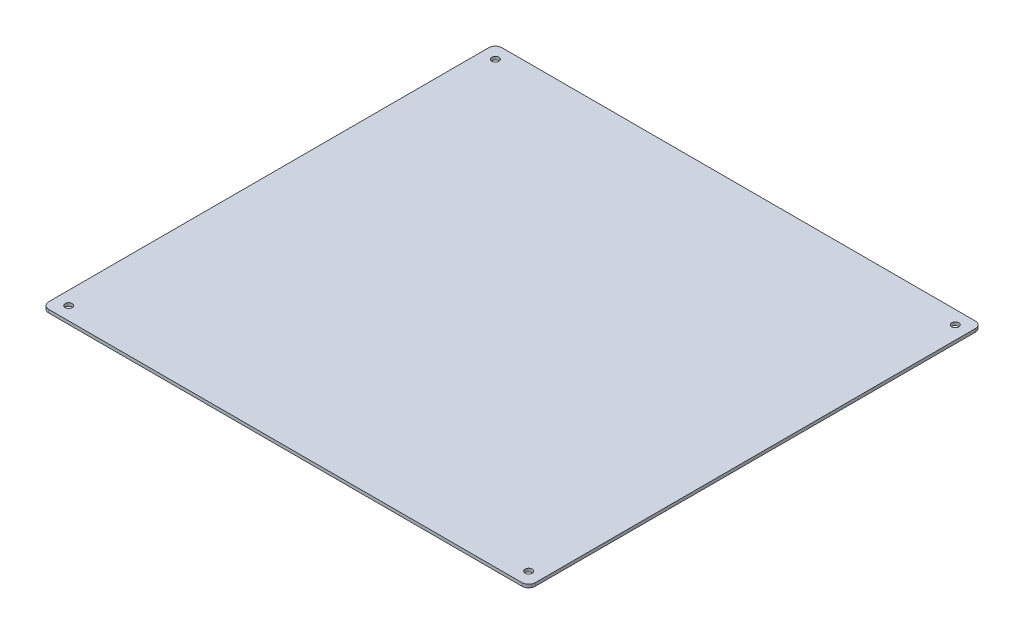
ISO-10303-21;
HEADER;
FILE_DESCRIPTION(('STEP AP214'),'2;1');
FILE_NAME('part.step','',(''),(''),'','','');
FILE_SCHEMA(('AUTOMOTIVE_DESIGN { 1 0 10303 214 1 1 1 1 }'));
ENDSEC;
DATA;
#1=APPLICATION_CONTEXT('core data for automotive mechanical design processes');
#2=APPLICATION_PROTOCOL_DEFINITION('international standard','automotive_design',2000,#1);
#3=PRODUCT_CONTEXT('',#1,'mechanical');
#4=PRODUCT('Part','Part','',(#3));
#5=PRODUCT_RELATED_PRODUCT_CATEGORY('part','',(#4));
#6=PRODUCT_DEFINITION_FORMATION('','',#4);
#7=PRODUCT_DEFINITION_CONTEXT('part definition',#1,'design');
#8=PRODUCT_DEFINITION('design','',#6,#7);
#9=PRODUCT_DEFINITION_SHAPE('','',#8);
#10=(LENGTH_UNIT() NAMED_UNIT(*) SI_UNIT(.MILLI.,.METRE.));
#11=(NAMED_UNIT(*) PLANE_ANGLE_UNIT() SI_UNIT($,.RADIAN.));
#12=(NAMED_UNIT(*) SI_UNIT($,.STERADIAN.) SOLID_ANGLE_UNIT());
#13=UNCERTAINTY_MEASURE_WITH_UNIT(LENGTH_MEASURE(1.E-05),#10,'distance_accuracy_value','');
#14=(GEOMETRIC_REPRESENTATION_CONTEXT(3) GLOBAL_UNCERTAINTY_ASSIGNED_CONTEXT((#13)) GLOBAL_UNIT_ASSIGNED_CONTEXT((#10,
#11,#12)) REPRESENTATION_CONTEXT('',''));
#15=CARTESIAN_POINT('',(0.,0.,0.));
#16=DIRECTION('',(0.,0.,1.));
#17=DIRECTION('',(1.,0.,0.));
#18=AXIS2_PLACEMENT_3D('',#15,#16,#17);
#19=CARTESIAN_POINT('',(0.,0.,0.));
#20=DIRECTION('',(0.,-1.,0.));
#21=DIRECTION('',(0.,0.,-1.));
#22=AXIS2_PLACEMENT_3D('',#19,#20,#21);
#23=PLANE('',#22);
#24=CARTESIAN_POINT('',(-219.075,0.,-203.2));
#25=DIRECTION('',(0.,1.,0.));
#26=DIRECTION('',(0.,0.,1.));
#27=AXIS2_PLACEMENT_3D('',#24,#25,#26);
#28=CIRCLE('',#27,3.373501);
#29=CARTESIAN_POINT('',(-219.075,0.,-199.826499));
#30=VERTEX_POINT('',#29);
#31=EDGE_CURVE('E229',#30,#30,#28,.T.);
#32=ORIENTED_EDGE('',*,*,#31,.T.);
#33=EDGE_LOOP('',(#32));
#34=FACE_BOUND('',#33,.T.);
#35=DIRECTION('',(-1.,0.,0.));
#36=VECTOR('',#35,1.);
#37=CARTESIAN_POINT('',(-231.775,0.,-215.9));
#38=LINE('',#37,#36);
#39=CARTESIAN_POINT('',(225.425,0.,-215.9));
#40=VERTEX_POINT('',#39);
#41=CARTESIAN_POINT('',(-225.425,0.,-215.9));
#42=VERTEX_POINT('',#41);
#43=EDGE_CURVE('E121',#40,#42,#38,.T.);
#44=ORIENTED_EDGE('',*,*,#43,.F.);
#45=CARTESIAN_POINT('',(225.425,0.,-209.55));
#46=DIRECTION('',(0.,-1.,0.));
#47=DIRECTION('',(0.,0.,-1.));
#48=AXIS2_PLACEMENT_3D('',#45,#46,#47);
#49=CIRCLE('',#48,6.35);
#50=CARTESIAN_POINT('',(231.775,0.,-209.55));
#51=VERTEX_POINT('',#50);
#52=EDGE_CURVE('E103',#40,#51,#49,.T.);
#53=ORIENTED_EDGE('',*,*,#52,.T.);
#54=DIRECTION('',(0.,0.,-1.));
#55=VECTOR('',#54,1.);
#56=CARTESIAN_POINT('',(231.775,0.,215.9));
#57=LINE('',#56,#55);
#58=CARTESIAN_POINT('',(231.775,0.,209.55));
#59=VERTEX_POINT('',#58);
#60=EDGE_CURVE('E133',#59,#51,#57,.T.);
#61=ORIENTED_EDGE('',*,*,#60,.F.);
#62=CARTESIAN_POINT('',(225.425,0.,209.55));
#63=DIRECTION('',(0.,-1.,0.));
#64=DIRECTION('',(0.,0.,-1.));
#65=AXIS2_PLACEMENT_3D('',#62,#63,#64);
#66=CIRCLE('',#65,6.35);
#67=CARTESIAN_POINT('',(225.425,0.,215.9));
#68=VERTEX_POINT('',#67);
#69=EDGE_CURVE('E115',#59,#68,#66,.T.);
#70=ORIENTED_EDGE('',*,*,#69,.T.);
#71=DIRECTION('',(1.,0.,0.));
#72=VECTOR('',#71,1.);
#73=CARTESIAN_POINT('',(-231.775,0.,215.9));
#74=LINE('',#73,#72);
#75=CARTESIAN_POINT('',(-225.425,0.,215.9));
#76=VERTEX_POINT('',#75);
#77=EDGE_CURVE('E139',#76,#68,#74,.T.);
#78=ORIENTED_EDGE('',*,*,#77,.F.);
#79=CARTESIAN_POINT('',(-225.425,0.,209.55));
#80=DIRECTION('',(0.,-1.,0.));
#81=DIRECTION('',(0.,0.,-1.));
#82=AXIS2_PLACEMENT_3D('',#79,#80,#81);
#83=CIRCLE('',#82,6.35);
#84=CARTESIAN_POINT('',(-231.775,0.,209.55));
#85=VERTEX_POINT('',#84);
#86=EDGE_CURVE('E153',#76,#85,#83,.T.);
#87=ORIENTED_EDGE('',*,*,#86,.T.);
#88=DIRECTION('',(0.,0.,1.));
#89=VECTOR('',#88,1.);
#90=CARTESIAN_POINT('',(-231.775,0.,215.9));
#91=LINE('',#90,#89);
#92=CARTESIAN_POINT('',(-231.775,0.,-209.55));
#93=VERTEX_POINT('',#92);
#94=EDGE_CURVE('E132',#93,#85,#91,.T.);
#95=ORIENTED_EDGE('',*,*,#94,.F.);
#96=CARTESIAN_POINT('',(-225.425,0.,-209.55));
#97=DIRECTION('',(0.,-1.,0.));
#98=DIRECTION('',(0.,0.,-1.));
#99=AXIS2_PLACEMENT_3D('',#96,#97,#98);
#100=CIRCLE('',#99,6.35);
#101=EDGE_CURVE('E126',#93,#42,#100,.T.);
#102=ORIENTED_EDGE('',*,*,#101,.T.);
#103=EDGE_LOOP('',(#44,#53,#61,#70,#78,#87,#95,#102));
#104=FACE_BOUND('',#103,.T.);
#105=CARTESIAN_POINT('',(219.075,0.,-203.2));
#106=DIRECTION('',(0.,1.,0.));
#107=DIRECTION('',(0.,0.,1.));
#108=AXIS2_PLACEMENT_3D('',#105,#106,#107);
#109=CIRCLE('',#108,3.373501);
#110=CARTESIAN_POINT('',(219.075,0.,-199.826499));
#111=VERTEX_POINT('',#110);
#112=EDGE_CURVE('E141',#111,#111,#109,.T.);
#113=ORIENTED_EDGE('',*,*,#112,.T.);
#114=EDGE_LOOP('',(#113));
#115=FACE_BOUND('',#114,.T.);
#116=CARTESIAN_POINT('',(219.075,0.,203.2));
#117=DIRECTION('',(0.,1.,0.));
#118=DIRECTION('',(0.,0.,1.));
#119=AXIS2_PLACEMENT_3D('',#116,#117,#118);
#120=CIRCLE('',#119,3.373501);
#121=CARTESIAN_POINT('',(219.075,0.,206.573501));
#122=VERTEX_POINT('',#121);
#123=EDGE_CURVE('E213',#122,#122,#120,.T.);
#124=ORIENTED_EDGE('',*,*,#123,.T.);
#125=EDGE_LOOP('',(#124));
#126=FACE_BOUND('',#125,.T.);
#127=CARTESIAN_POINT('',(-219.075,0.,203.2));
#128=DIRECTION('',(0.,1.,0.));
#129=DIRECTION('',(0.,0.,1.));
#130=AXIS2_PLACEMENT_3D('',#127,#128,#129);
#131=CIRCLE('',#130,3.373501);
#132=CARTESIAN_POINT('',(-219.075,0.,206.573501));
#133=VERTEX_POINT('',#132);
#134=EDGE_CURVE('E221',#133,#133,#131,.T.);
#135=ORIENTED_EDGE('',*,*,#134,.T.);
#136=EDGE_LOOP('',(#135));
#137=FACE_BOUND('',#136,.T.);
#138=ADVANCED_FACE('F36',(#34,#104,#115,#126,#137),#23,.T.);
#139=CARTESIAN_POINT('',(231.775,2.9972,215.9));
#140=DIRECTION('',(-1.,0.,0.));
#141=DIRECTION('',(0.,0.,1.));
#142=AXIS2_PLACEMENT_3D('',#139,#140,#141);
#143=PLANE('',#142);
#144=ORIENTED_EDGE('',*,*,#60,.T.);
#145=DIRECTION('',(0.,-1.,0.));
#146=VECTOR('',#145,1.);
#147=CARTESIAN_POINT('',(231.775,2.9972,-209.55));
#148=LINE('',#147,#146);
#149=CARTESIAN_POINT('',(231.775,2.9972,-209.55));
#150=VERTEX_POINT('',#149);
#151=EDGE_CURVE('E108',#51,#150,#148,.F.);
#152=ORIENTED_EDGE('',*,*,#151,.T.);
#153=DIRECTION('',(0.,0.,-1.));
#154=VECTOR('',#153,1.);
#155=CARTESIAN_POINT('',(231.775,2.9972,215.9));
#156=LINE('',#155,#154);
#157=CARTESIAN_POINT('',(231.775,2.9972,209.55));
#158=VERTEX_POINT('',#157);
#159=EDGE_CURVE('E147',#158,#150,#156,.T.);
#160=ORIENTED_EDGE('',*,*,#159,.F.);
#161=DIRECTION('',(0.,-1.,0.));
#162=VECTOR('',#161,1.);
#163=CARTESIAN_POINT('',(231.775,2.9972,209.55));
#164=LINE('',#163,#162);
#165=EDGE_CURVE('E114',#158,#59,#164,.T.);
#166=ORIENTED_EDGE('',*,*,#165,.T.);
#167=EDGE_LOOP('',(#144,#152,#160,#166));
#168=FACE_BOUND('',#167,.T.);
#169=ADVANCED_FACE('F254',(#168),#143,.F.);
#170=CARTESIAN_POINT('',(-231.775,2.9972,-215.9));
#171=DIRECTION('',(0.,0.,1.));
#172=DIRECTION('',(1.,0.,0.));
#173=AXIS2_PLACEMENT_3D('',#170,#171,#172);
#174=PLANE('',#173);
#175=DIRECTION('',(-1.,0.,0.));
#176=VECTOR('',#175,1.);
#177=CARTESIAN_POINT('',(-231.775,2.9972,-215.9));
#178=LINE('',#177,#176);
#179=CARTESIAN_POINT('',(225.425,2.9972,-215.9));
#180=VERTEX_POINT('',#179);
#181=CARTESIAN_POINT('',(-225.425,2.9972,-215.9));
#182=VERTEX_POINT('',#181);
#183=EDGE_CURVE('E124',#180,#182,#178,.T.);
#184=ORIENTED_EDGE('',*,*,#183,.F.);
#185=DIRECTION('',(0.,-1.,0.));
#186=VECTOR('',#185,1.);
#187=CARTESIAN_POINT('',(225.425,2.9972,-215.9));
#188=LINE('',#187,#186);
#189=EDGE_CURVE('E107',#180,#40,#188,.T.);
#190=ORIENTED_EDGE('',*,*,#189,.T.);
#191=ORIENTED_EDGE('',*,*,#43,.T.);
#192=DIRECTION('',(0.,-1.,0.));
#193=VECTOR('',#192,1.);
#194=CARTESIAN_POINT('',(-225.425,2.9972,-215.9));
#195=LINE('',#194,#193);
#196=EDGE_CURVE('E127',#42,#182,#195,.F.);
#197=ORIENTED_EDGE('',*,*,#196,.T.);
#198=EDGE_LOOP('',(#184,#190,#191,#197));
#199=FACE_BOUND('',#198,.T.);
#200=ADVANCED_FACE('F120',(#199),#174,.F.);
#201=CARTESIAN_POINT('',(-231.775,2.9972,215.9));
#202=DIRECTION('',(1.,0.,0.));
#203=DIRECTION('',(0.,0.,-1.));
#204=AXIS2_PLACEMENT_3D('',#201,#202,#203);
#205=PLANE('',#204);
#206=ORIENTED_EDGE('',*,*,#94,.T.);
#207=DIRECTION('',(0.,-1.,0.));
#208=VECTOR('',#207,1.);
#209=CARTESIAN_POINT('',(-231.775,2.9972,209.55));
#210=LINE('',#209,#208);
#211=CARTESIAN_POINT('',(-231.775,2.9972,209.55));
#212=VERTEX_POINT('',#211);
#213=EDGE_CURVE('E11',#85,#212,#210,.F.);
#214=ORIENTED_EDGE('',*,*,#213,.T.);
#215=DIRECTION('',(0.,0.,1.));
#216=VECTOR('',#215,1.);
#217=CARTESIAN_POINT('',(-231.775,2.9972,215.9));
#218=LINE('',#217,#216);
#219=CARTESIAN_POINT('',(-231.775,2.9972,-209.55));
#220=VERTEX_POINT('',#219);
#221=EDGE_CURVE('E187',#220,#212,#218,.T.);
#222=ORIENTED_EDGE('',*,*,#221,.F.);
#223=DIRECTION('',(0.,-1.,0.));
#224=VECTOR('',#223,1.);
#225=CARTESIAN_POINT('',(-231.775,2.9972,-209.55));
#226=LINE('',#225,#224);
#227=EDGE_CURVE('E45',#220,#93,#226,.T.);
#228=ORIENTED_EDGE('',*,*,#227,.T.);
#229=EDGE_LOOP('',(#206,#214,#222,#228));
#230=FACE_BOUND('',#229,.T.);
#231=ADVANCED_FACE('F185',(#230),#205,.F.);
#232=CARTESIAN_POINT('',(-231.775,2.9972,215.9));
#233=DIRECTION('',(0.,0.,-1.));
#234=DIRECTION('',(-1.,0.,0.));
#235=AXIS2_PLACEMENT_3D('',#232,#233,#234);
#236=PLANE('',#235);
#237=ORIENTED_EDGE('',*,*,#77,.T.);
#238=DIRECTION('',(0.,-1.,0.));
#239=VECTOR('',#238,1.);
#240=CARTESIAN_POINT('',(225.425,2.9972,215.9));
#241=LINE('',#240,#239);
#242=CARTESIAN_POINT('',(225.425,2.9972,215.9));
#243=VERTEX_POINT('',#242);
#244=EDGE_CURVE('E52',#68,#243,#241,.F.);
#245=ORIENTED_EDGE('',*,*,#244,.T.);
#246=DIRECTION('',(1.,0.,0.));
#247=VECTOR('',#246,1.);
#248=CARTESIAN_POINT('',(-231.775,2.9972,215.9));
#249=LINE('',#248,#247);
#250=CARTESIAN_POINT('',(-225.425,2.9972,215.9));
#251=VERTEX_POINT('',#250);
#252=EDGE_CURVE('E149',#251,#243,#249,.T.);
#253=ORIENTED_EDGE('',*,*,#252,.F.);
#254=DIRECTION('',(0.,-1.,0.));
#255=VECTOR('',#254,1.);
#256=CARTESIAN_POINT('',(-225.425,2.9972,215.9));
#257=LINE('',#256,#255);
#258=EDGE_CURVE('E174',#251,#76,#257,.T.);
#259=ORIENTED_EDGE('',*,*,#258,.T.);
#260=EDGE_LOOP('',(#237,#245,#253,#259));
#261=FACE_BOUND('',#260,.T.);
#262=ADVANCED_FACE('F194',(#261),#236,.F.);
#263=CARTESIAN_POINT('',(0.,2.9972,0.));
#264=DIRECTION('',(0.,-1.,0.));
#265=DIRECTION('',(0.,0.,-1.));
#266=AXIS2_PLACEMENT_3D('',#263,#264,#265);
#267=PLANE('',#266);
#268=CARTESIAN_POINT('',(-219.075,2.9972,-203.2));
#269=DIRECTION('',(0.,1.,0.));
#270=DIRECTION('',(0.,0.,1.));
#271=AXIS2_PLACEMENT_3D('',#268,#269,#270);
#272=CIRCLE('',#271,3.373501);
#273=CARTESIAN_POINT('',(-219.075,2.9972,-199.826499));
#274=VERTEX_POINT('',#273);
#275=EDGE_CURVE('E233',#274,#274,#272,.T.);
#276=ORIENTED_EDGE('',*,*,#275,.F.);
#277=EDGE_LOOP('',(#276));
#278=FACE_BOUND('',#277,.T.);
#279=CARTESIAN_POINT('',(-219.075,2.9972,203.2));
#280=DIRECTION('',(0.,1.,0.));
#281=DIRECTION('',(0.,0.,1.));
#282=AXIS2_PLACEMENT_3D('',#279,#280,#281);
#283=CIRCLE('',#282,3.373501);
#284=CARTESIAN_POINT('',(-219.075,2.9972,206.573501));
#285=VERTEX_POINT('',#284);
#286=EDGE_CURVE('E225',#285,#285,#283,.T.);
#287=ORIENTED_EDGE('',*,*,#286,.F.);
#288=EDGE_LOOP('',(#287));
#289=FACE_BOUND('',#288,.T.);
#290=CARTESIAN_POINT('',(219.075,2.9972,203.2));
#291=DIRECTION('',(0.,1.,0.));
#292=DIRECTION('',(0.,0.,1.));
#293=AXIS2_PLACEMENT_3D('',#290,#291,#292);
#294=CIRCLE('',#293,3.373501);
#295=CARTESIAN_POINT('',(219.075,2.9972,206.573501));
#296=VERTEX_POINT('',#295);
#297=EDGE_CURVE('E217',#296,#296,#294,.T.);
#298=ORIENTED_EDGE('',*,*,#297,.F.);
#299=EDGE_LOOP('',(#298));
#300=FACE_BOUND('',#299,.T.);
#301=CARTESIAN_POINT('',(219.075,2.9972,-203.2));
#302=DIRECTION('',(0.,1.,0.));
#303=DIRECTION('',(0.,0.,1.));
#304=AXIS2_PLACEMENT_3D('',#301,#302,#303);
#305=CIRCLE('',#304,3.373501);
#306=CARTESIAN_POINT('',(219.075,2.9972,-199.826499));
#307=VERTEX_POINT('',#306);
#308=EDGE_CURVE('E209',#307,#307,#305,.T.);
#309=ORIENTED_EDGE('',*,*,#308,.F.);
#310=EDGE_LOOP('',(#309));
#311=FACE_BOUND('',#310,.T.);
#312=ORIENTED_EDGE('',*,*,#159,.T.);
#313=CARTESIAN_POINT('',(225.425,2.9972,-209.55));
#314=DIRECTION('',(0.,-1.,0.));
#315=DIRECTION('',(0.,0.,-1.));
#316=AXIS2_PLACEMENT_3D('',#313,#314,#315);
#317=CIRCLE('',#316,6.35);
#318=EDGE_CURVE('E171',#150,#180,#317,.F.);
#319=ORIENTED_EDGE('',*,*,#318,.T.);
#320=ORIENTED_EDGE('',*,*,#183,.T.);
#321=CARTESIAN_POINT('',(-225.425,2.9972,-209.55));
#322=DIRECTION('',(0.,-1.,0.));
#323=DIRECTION('',(0.,0.,-1.));
#324=AXIS2_PLACEMENT_3D('',#321,#322,#323);
#325=CIRCLE('',#324,6.35);
#326=EDGE_CURVE('E163',#182,#220,#325,.F.);
#327=ORIENTED_EDGE('',*,*,#326,.T.);
#328=ORIENTED_EDGE('',*,*,#221,.T.);
#329=CARTESIAN_POINT('',(-225.425,2.9972,209.55));
#330=DIRECTION('',(0.,-1.,0.));
#331=DIRECTION('',(0.,0.,-1.));
#332=AXIS2_PLACEMENT_3D('',#329,#330,#331);
#333=CIRCLE('',#332,6.35);
#334=EDGE_CURVE('E59',#212,#251,#333,.F.);
#335=ORIENTED_EDGE('',*,*,#334,.T.);
#336=ORIENTED_EDGE('',*,*,#252,.T.);
#337=CARTESIAN_POINT('',(225.425,2.9972,209.55));
#338=DIRECTION('',(0.,-1.,0.));
#339=DIRECTION('',(0.,0.,-1.));
#340=AXIS2_PLACEMENT_3D('',#337,#338,#339);
#341=CIRCLE('',#340,6.35);
#342=EDGE_CURVE('E168',#243,#158,#341,.F.);
#343=ORIENTED_EDGE('',*,*,#342,.T.);
#344=EDGE_LOOP('',(#312,#319,#320,#327,#328,#335,#336,#343));
#345=FACE_BOUND('',#344,.T.);
#346=ADVANCED_FACE('F241',(#278,#289,#300,#311,#345),#267,.F.);
#347=CARTESIAN_POINT('',(219.075,2.9972,-203.2));
#348=DIRECTION('',(0.,1.,0.));
#349=DIRECTION('',(0.,0.,1.));
#350=AXIS2_PLACEMENT_3D('',#347,#348,#349);
#351=CYLINDRICAL_SURFACE('',#350,3.373501);
#352=ORIENTED_EDGE('',*,*,#112,.F.);
#353=EDGE_LOOP('',(#352));
#354=FACE_BOUND('',#353,.T.);
#355=ORIENTED_EDGE('',*,*,#308,.T.);
#356=EDGE_LOOP('',(#355));
#357=FACE_BOUND('',#356,.T.);
#358=ADVANCED_FACE('F244',(#354,#357),#351,.F.);
#359=CARTESIAN_POINT('',(219.075,2.9972,203.2));
#360=DIRECTION('',(0.,1.,0.));
#361=DIRECTION('',(0.,0.,1.));
#362=AXIS2_PLACEMENT_3D('',#359,#360,#361);
#363=CYLINDRICAL_SURFACE('',#362,3.373501);
#364=ORIENTED_EDGE('',*,*,#123,.F.);
#365=EDGE_LOOP('',(#364));
#366=FACE_BOUND('',#365,.T.);
#367=ORIENTED_EDGE('',*,*,#297,.T.);
#368=EDGE_LOOP('',(#367));
#369=FACE_BOUND('',#368,.T.);
#370=ADVANCED_FACE('F300',(#366,#369),#363,.F.);
#371=CARTESIAN_POINT('',(-219.075,2.9972,203.2));
#372=DIRECTION('',(0.,1.,0.));
#373=DIRECTION('',(0.,0.,1.));
#374=AXIS2_PLACEMENT_3D('',#371,#372,#373);
#375=CYLINDRICAL_SURFACE('',#374,3.373501);
#376=ORIENTED_EDGE('',*,*,#134,.F.);
#377=EDGE_LOOP('',(#376));
#378=FACE_BOUND('',#377,.T.);
#379=ORIENTED_EDGE('',*,*,#286,.T.);
#380=EDGE_LOOP('',(#379));
#381=FACE_BOUND('',#380,.T.);
#382=ADVANCED_FACE('F307',(#378,#381),#375,.F.);
#383=CARTESIAN_POINT('',(-219.075,2.9972,-203.2));
#384=DIRECTION('',(0.,1.,0.));
#385=DIRECTION('',(0.,0.,1.));
#386=AXIS2_PLACEMENT_3D('',#383,#384,#385);
#387=CYLINDRICAL_SURFACE('',#386,3.373501);
#388=ORIENTED_EDGE('',*,*,#31,.F.);
#389=EDGE_LOOP('',(#388));
#390=FACE_BOUND('',#389,.T.);
#391=ORIENTED_EDGE('',*,*,#275,.T.);
#392=EDGE_LOOP('',(#391));
#393=FACE_BOUND('',#392,.T.);
#394=ADVANCED_FACE('F239',(#390,#393),#387,.F.);
#395=CARTESIAN_POINT('',(225.425,2.9972,-209.55));
#396=DIRECTION('',(0.,-1.,0.));
#397=DIRECTION('',(0.,0.,-1.));
#398=AXIS2_PLACEMENT_3D('',#395,#396,#397);
#399=CYLINDRICAL_SURFACE('',#398,6.35);
#400=ORIENTED_EDGE('',*,*,#318,.F.);
#401=ORIENTED_EDGE('',*,*,#151,.F.);
#402=ORIENTED_EDGE('',*,*,#52,.F.);
#403=ORIENTED_EDGE('',*,*,#189,.F.);
#404=EDGE_LOOP('',(#400,#401,#402,#403));
#405=FACE_BOUND('',#404,.T.);
#406=ADVANCED_FACE('F106',(#405),#399,.T.);
#407=CARTESIAN_POINT('',(225.425,2.9972,209.55));
#408=DIRECTION('',(0.,-1.,0.));
#409=DIRECTION('',(0.,0.,-1.));
#410=AXIS2_PLACEMENT_3D('',#407,#408,#409);
#411=CYLINDRICAL_SURFACE('',#410,6.35);
#412=ORIENTED_EDGE('',*,*,#342,.F.);
#413=ORIENTED_EDGE('',*,*,#244,.F.);
#414=ORIENTED_EDGE('',*,*,#69,.F.);
#415=ORIENTED_EDGE('',*,*,#165,.F.);
#416=EDGE_LOOP('',(#412,#413,#414,#415));
#417=FACE_BOUND('',#416,.T.);
#418=ADVANCED_FACE('F256',(#417),#411,.T.);
#419=CARTESIAN_POINT('',(-225.425,2.9972,209.55));
#420=DIRECTION('',(0.,-1.,0.));
#421=DIRECTION('',(0.,0.,-1.));
#422=AXIS2_PLACEMENT_3D('',#419,#420,#421);
#423=CYLINDRICAL_SURFACE('',#422,6.35);
#424=ORIENTED_EDGE('',*,*,#334,.F.);
#425=ORIENTED_EDGE('',*,*,#213,.F.);
#426=ORIENTED_EDGE('',*,*,#86,.F.);
#427=ORIENTED_EDGE('',*,*,#258,.F.);
#428=EDGE_LOOP('',(#424,#425,#426,#427));
#429=FACE_BOUND('',#428,.T.);
#430=ADVANCED_FACE('F193',(#429),#423,.T.);
#431=CARTESIAN_POINT('',(-225.425,2.9972,-209.55));
#432=DIRECTION('',(0.,-1.,0.));
#433=DIRECTION('',(0.,0.,-1.));
#434=AXIS2_PLACEMENT_3D('',#431,#432,#433);
#435=CYLINDRICAL_SURFACE('',#434,6.35);
#436=ORIENTED_EDGE('',*,*,#326,.F.);
#437=ORIENTED_EDGE('',*,*,#196,.F.);
#438=ORIENTED_EDGE('',*,*,#101,.F.);
#439=ORIENTED_EDGE('',*,*,#227,.F.);
#440=EDGE_LOOP('',(#436,#437,#438,#439));
#441=FACE_BOUND('',#440,.T.);
#442=ADVANCED_FACE('F38',(#441),#435,.T.);
#443=CLOSED_SHELL('',(#138,#169,#200,#231,#262,#346,#358,#370,#382,#394,#406,#418,#430,#442));
#444=MANIFOLD_SOLID_BREP('B2',#443);
#445=ADVANCED_BREP_SHAPE_REPRESENTATION('',(#18,#444),#14);
#446=SHAPE_DEFINITION_REPRESENTATION(#9,#445);
ENDSEC;
END-ISO-10303-21;
